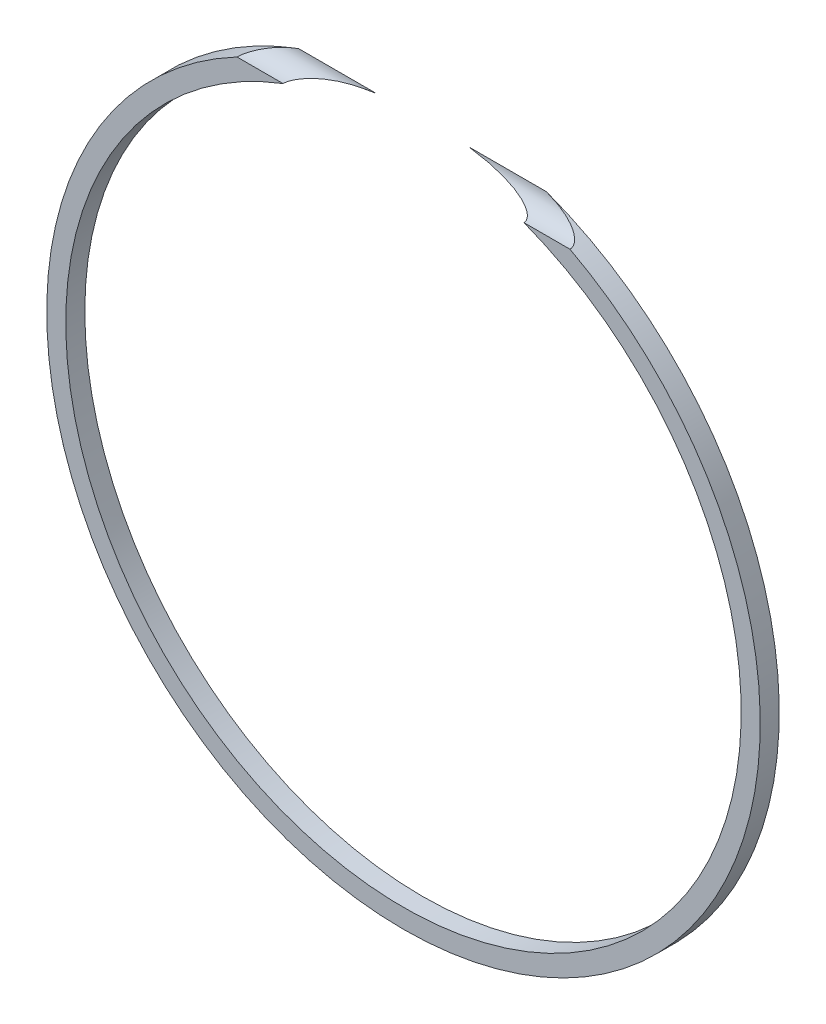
ISO-10303-21;
HEADER;
FILE_DESCRIPTION(('STEP AP214'),'2;1');
FILE_NAME('part.step','',(''),(''),'','','');
FILE_SCHEMA(('AUTOMOTIVE_DESIGN { 1 0 10303 214 1 1 1 1 }'));
ENDSEC;
DATA;
#1=APPLICATION_CONTEXT('core data for automotive mechanical design processes');
#2=APPLICATION_PROTOCOL_DEFINITION('international standard','automotive_design',2000,#1);
#3=PRODUCT_CONTEXT('',#1,'mechanical');
#4=PRODUCT('Part','Part','',(#3));
#5=PRODUCT_RELATED_PRODUCT_CATEGORY('part','',(#4));
#6=PRODUCT_DEFINITION_FORMATION('','',#4);
#7=PRODUCT_DEFINITION_CONTEXT('part definition',#1,'design');
#8=PRODUCT_DEFINITION('design','',#6,#7);
#9=PRODUCT_DEFINITION_SHAPE('','',#8);
#10=(LENGTH_UNIT() NAMED_UNIT(*) SI_UNIT(.MILLI.,.METRE.));
#11=(NAMED_UNIT(*) PLANE_ANGLE_UNIT() SI_UNIT($,.RADIAN.));
#12=(NAMED_UNIT(*) SI_UNIT($,.STERADIAN.) SOLID_ANGLE_UNIT());
#13=UNCERTAINTY_MEASURE_WITH_UNIT(LENGTH_MEASURE(1.E-05),#10,'distance_accuracy_value','');
#14=(GEOMETRIC_REPRESENTATION_CONTEXT(3) GLOBAL_UNCERTAINTY_ASSIGNED_CONTEXT((#13)) GLOBAL_UNIT_ASSIGNED_CONTEXT((#10,
#11,#12)) REPRESENTATION_CONTEXT('',''));
#15=CARTESIAN_POINT('',(0.,0.,0.));
#16=DIRECTION('',(0.,0.,1.));
#17=DIRECTION('',(1.,0.,0.));
#18=AXIS2_PLACEMENT_3D('',#15,#16,#17);
#19=CARTESIAN_POINT('',(0.,0.,1.2));
#20=DIRECTION('',(0.,0.,1.));
#21=DIRECTION('',(1.,0.,0.));
#22=AXIS2_PLACEMENT_3D('',#19,#20,#21);
#23=PLANE('',#22);
#24=DIRECTION('',(1.,0.,0.));
#25=VECTOR('',#24,1.);
#26=CARTESIAN_POINT('',(-22.5,19.8997487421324,1.2));
#27=LINE('',#26,#25);
#28=CARTESIAN_POINT('',(-10.5,19.8997487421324,1.2));
#29=VERTEX_POINT('',#28);
#30=CARTESIAN_POINT('',(-7.59539334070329,19.8997487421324,1.2));
#31=VERTEX_POINT('',#30);
#32=EDGE_CURVE('E61',#29,#31,#27,.T.);
#33=ORIENTED_EDGE('',*,*,#32,.F.);
#34=CARTESIAN_POINT('',(0.,0.,1.2));
#35=DIRECTION('',(0.,0.,1.));
#36=DIRECTION('',(1.,0.,0.));
#37=AXIS2_PLACEMENT_3D('',#34,#35,#36);
#38=CIRCLE('',#37,22.5);
#39=CARTESIAN_POINT('',(10.5,19.8997487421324,1.2));
#40=VERTEX_POINT('',#39);
#41=EDGE_CURVE('E93',#29,#40,#38,.T.);
#42=ORIENTED_EDGE('',*,*,#41,.T.);
#43=CARTESIAN_POINT('',(7.59539334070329,19.8997487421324,1.2));
#44=VERTEX_POINT('',#43);
#45=EDGE_CURVE('E85',#44,#40,#27,.T.);
#46=ORIENTED_EDGE('',*,*,#45,.F.);
#47=CARTESIAN_POINT('',(0.,0.,1.2));
#48=DIRECTION('',(0.,0.,1.));
#49=DIRECTION('',(1.,0.,0.));
#50=AXIS2_PLACEMENT_3D('',#47,#48,#49);
#51=CIRCLE('',#50,21.3);
#52=EDGE_CURVE('E97',#31,#44,#51,.T.);
#53=ORIENTED_EDGE('',*,*,#52,.F.);
#54=EDGE_LOOP('',(#33,#42,#46,#53));
#55=FACE_BOUND('',#54,.T.);
#56=ADVANCED_FACE('F33',(#55),#23,.T.);
#57=CARTESIAN_POINT('',(0.,0.,0.));
#58=DIRECTION('',(0.,0.,1.));
#59=DIRECTION('',(1.,0.,0.));
#60=AXIS2_PLACEMENT_3D('',#57,#58,#59);
#61=PLANE('',#60);
#62=CARTESIAN_POINT('',(0.,0.,0.));
#63=DIRECTION('',(0.,0.,1.));
#64=DIRECTION('',(1.,0.,0.));
#65=AXIS2_PLACEMENT_3D('',#62,#63,#64);
#66=CIRCLE('',#65,22.5);
#67=CARTESIAN_POINT('',(-7.81348853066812,21.0997487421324,0.));
#68=VERTEX_POINT('',#67);
#69=CARTESIAN_POINT('',(7.81348853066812,21.0997487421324,0.));
#70=VERTEX_POINT('',#69);
#71=EDGE_CURVE('E91',#68,#70,#66,.T.);
#72=ORIENTED_EDGE('',*,*,#71,.F.);
#73=DIRECTION('',(1.,0.,0.));
#74=VECTOR('',#73,1.);
#75=CARTESIAN_POINT('',(-22.5,21.0997487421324,0.));
#76=LINE('',#75,#74);
#77=CARTESIAN_POINT('',(-2.91386393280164,21.0997487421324,0.));
#78=VERTEX_POINT('',#77);
#79=EDGE_CURVE('E77',#68,#78,#76,.T.);
#80=ORIENTED_EDGE('',*,*,#79,.T.);
#81=CARTESIAN_POINT('',(0.,0.,0.));
#82=DIRECTION('',(0.,0.,1.));
#83=DIRECTION('',(1.,0.,0.));
#84=AXIS2_PLACEMENT_3D('',#81,#82,#83);
#85=CIRCLE('',#84,21.3);
#86=CARTESIAN_POINT('',(2.91386393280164,21.0997487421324,0.));
#87=VERTEX_POINT('',#86);
#88=EDGE_CURVE('E94',#78,#87,#85,.T.);
#89=ORIENTED_EDGE('',*,*,#88,.T.);
#90=EDGE_CURVE('E54',#87,#70,#76,.T.);
#91=ORIENTED_EDGE('',*,*,#90,.T.);
#92=EDGE_LOOP('',(#72,#80,#89,#91));
#93=FACE_BOUND('',#92,.T.);
#94=ADVANCED_FACE('F96',(#93),#61,.F.);
#95=CARTESIAN_POINT('',(0.,0.,1.2));
#96=DIRECTION('',(0.,0.,-1.));
#97=DIRECTION('',(-1.,0.,0.));
#98=AXIS2_PLACEMENT_3D('',#95,#96,#97);
#99=CYLINDRICAL_SURFACE('',#98,22.5);
#100=ORIENTED_EDGE('',*,*,#41,.F.);
#101=CARTESIAN_POINT('',(-10.5,19.8997487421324,1.2));
#102=CARTESIAN_POINT('',(-10.5000735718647,19.8997075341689,1.16593207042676));
#103=CARTESIAN_POINT('',(-10.4972544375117,19.9011975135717,1.13197076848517));
#104=CARTESIAN_POINT('',(-10.4865066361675,19.9068641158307,1.06545761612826));
#105=CARTESIAN_POINT('',(-10.4786330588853,19.9110117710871,1.03289456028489));
#106=CARTESIAN_POINT('',(-10.4561510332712,19.9228283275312,0.962480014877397));
#107=CARTESIAN_POINT('',(-10.4404249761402,19.9310799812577,0.925089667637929));
#108=CARTESIAN_POINT('',(-10.4037683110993,19.9502390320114,0.853582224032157));
#109=CARTESIAN_POINT('',(-10.3828150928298,19.9611579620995,0.819480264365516));
#110=CARTESIAN_POINT('',(-10.3246976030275,19.9913025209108,0.73720601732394));
#111=CARTESIAN_POINT('',(-10.2848940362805,20.0118272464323,0.691396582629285));
#112=CARTESIAN_POINT('',(-10.1995869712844,20.0554416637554,0.606967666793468));
#113=CARTESIAN_POINT('',(-10.15407213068,20.0785364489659,0.568362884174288));
#114=CARTESIAN_POINT('',(-10.0620292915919,20.1248123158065,0.499196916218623));
#115=CARTESIAN_POINT('',(-10.0157070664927,20.147913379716,0.468302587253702));
#116=CARTESIAN_POINT('',(-9.920706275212,20.1948607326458,0.41098102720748));
#117=CARTESIAN_POINT('',(-9.87202560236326,20.2187076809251,0.38455788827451));
#118=CARTESIAN_POINT('',(-9.77288202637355,20.2668157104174,0.335474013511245));
#119=CARTESIAN_POINT('',(-9.72241587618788,20.2910774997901,0.312820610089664));
#120=CARTESIAN_POINT('',(-9.6201911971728,20.3397427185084,0.270795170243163));
#121=CARTESIAN_POINT('',(-9.56843217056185,20.3641461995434,0.251424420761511));
#122=CARTESIAN_POINT('',(-9.40166590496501,20.4419814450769,0.194132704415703));
#123=CARTESIAN_POINT('',(-9.28477189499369,20.4953590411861,0.161605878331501));
#124=CARTESIAN_POINT('',(-9.04803222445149,20.6009703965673,0.106957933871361));
#125=CARTESIAN_POINT('',(-8.92818324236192,20.6532027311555,0.0848491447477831));
#126=CARTESIAN_POINT('',(-8.68652874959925,20.7559981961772,0.049001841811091));
#127=CARTESIAN_POINT('',(-8.56472279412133,20.8065609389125,0.0352652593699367));
#128=CARTESIAN_POINT('',(-8.31974405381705,20.9057247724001,0.0147082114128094));
#129=CARTESIAN_POINT('',(-8.19657114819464,20.9543256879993,0.00788836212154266));
#130=CARTESIAN_POINT('',(-8.02974301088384,21.0184530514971,0.00264165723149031));
#131=CARTESIAN_POINT('',(-7.98651198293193,21.0349178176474,0.00164115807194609));
#132=CARTESIAN_POINT('',(-7.90003359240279,21.0675484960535,0.000321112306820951));
#133=CARTESIAN_POINT('',(-7.8567864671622,21.0837149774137,9.83288500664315E-08));
#134=CARTESIAN_POINT('',(-7.81348853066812,21.0997487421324,0.));
#135=B_SPLINE_CURVE_WITH_KNOTS('',3,(#101,#102,#103,#104,#105,#106,#107,#108,#109,#110,#111,
#112,#113,#114,#115,#116,#117,#118,#119,#120,#121,#122,#123,#124,#125,#126,#127,#128,#129,#130,
#131,#132,#133,#134),.UNSPECIFIED.,.F.,.F.,(4,2,2,2,2,2,2,2,2,2,2,2,2,2,2,2,4),(0.,
0.101882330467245,0.20267264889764,0.326168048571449,0.450207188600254,0.641318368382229,
0.832815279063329,1.01339236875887,1.19413384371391,1.37522286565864,1.55638271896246,
1.9533722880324,2.35083050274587,2.74838037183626,3.14596565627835,3.28477501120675,
3.42328429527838),.UNSPECIFIED.);
#136=EDGE_CURVE('E80',#29,#68,#135,.T.);
#137=ORIENTED_EDGE('',*,*,#136,.T.);
#138=ORIENTED_EDGE('',*,*,#71,.T.);
#139=CARTESIAN_POINT('',(7.81348853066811,21.0997487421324,0.));
#140=CARTESIAN_POINT('',(7.8746874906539,21.0770860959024,1.72250712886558E-06));
#141=CARTESIAN_POINT('',(7.93578641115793,21.0541575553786,0.000641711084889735));
#142=CARTESIAN_POINT('',(8.05776390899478,21.0077771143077,0.00330393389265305));
#143=CARTESIAN_POINT('',(8.11864245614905,20.9843251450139,0.00532635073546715));
#144=CARTESIAN_POINT('',(8.30119667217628,20.913087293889,0.0136394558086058));
#145=CARTESIAN_POINT('',(8.42248457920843,20.8645329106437,0.0221770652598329));
#146=CARTESIAN_POINT('',(8.66292915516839,20.7658482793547,0.0462769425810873));
#147=CARTESIAN_POINT('',(8.78209394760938,20.7157283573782,0.0617996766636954));
#148=CARTESIAN_POINT('',(9.01826189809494,20.6140107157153,0.101345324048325));
#149=CARTESIAN_POINT('',(9.13526745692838,20.5624148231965,0.125358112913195));
#150=CARTESIAN_POINT('',(9.33069743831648,20.474271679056,0.175067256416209));
#151=CARTESIAN_POINT('',(9.40993668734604,20.4379683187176,0.197982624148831));
#152=CARTESIAN_POINT('',(9.56676158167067,20.3650330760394,0.250146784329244));
#153=CARTESIAN_POINT('',(9.64433632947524,20.3284004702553,0.27942827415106));
#154=CARTESIAN_POINT('',(9.77106963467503,20.2676927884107,0.334691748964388));
#155=CARTESIAN_POINT('',(9.82109934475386,20.2434927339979,0.358532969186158));
#156=CARTESIAN_POINT('',(9.91933130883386,20.1955403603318,0.410281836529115));
#157=CARTESIAN_POINT('',(9.96753195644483,20.1717884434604,0.438192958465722));
#158=CARTESIAN_POINT('',(10.0609714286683,20.1253460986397,0.498586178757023));
#159=CARTESIAN_POINT('',(10.1062293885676,20.1026491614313,0.531033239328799));
#160=CARTESIAN_POINT('',(10.1929380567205,20.0588224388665,0.601508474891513));
#161=CARTESIAN_POINT('',(10.2343973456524,20.037689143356,0.639523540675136));
#162=CARTESIAN_POINT('',(10.2999507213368,20.004048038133,0.709635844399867));
#163=CARTESIAN_POINT('',(10.3255001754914,19.9908669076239,0.740036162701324));
#164=CARTESIAN_POINT('',(10.372890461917,19.9663179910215,0.804373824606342));
#165=CARTESIAN_POINT('',(10.3947283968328,19.9549516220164,0.838313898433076));
#166=CARTESIAN_POINT('',(10.4336043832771,19.934652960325,0.910230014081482));
#167=CARTESIAN_POINT('',(10.4505717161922,19.9257565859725,0.948255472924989));
#168=CARTESIAN_POINT('',(10.4775694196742,19.911574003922,1.02728285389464));
#169=CARTESIAN_POINT('',(10.4876283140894,19.90627295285,1.06827175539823));
#170=CARTESIAN_POINT('',(10.4957109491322,19.9020113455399,1.12482502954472));
#171=CARTESIAN_POINT('',(10.497314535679,19.9011655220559,1.13979303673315));
#172=CARTESIAN_POINT('',(10.499459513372,19.9000339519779,1.16983742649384));
#173=CARTESIAN_POINT('',(10.5000000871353,19.8997486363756,1.1849138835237));
#174=CARTESIAN_POINT('',(10.5000000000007,19.8997487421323,1.19999999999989));
#175=B_SPLINE_CURVE_WITH_KNOTS('',3,(#139,#140,#141,#142,#143,#144,#145,#146,#147,#148,#149,
#150,#151,#152,#153,#154,#155,#156,#157,#158,#159,#160,#161,#162,#163,#164,#165,#166,#167,#168,
#169,#170,#171,#172,#173,#174),.UNSPECIFIED.,.F.,.F.,(4,2,2,2,2,2,2,2,2,2,2,2,2,2,2,2,2,4),(0.,
0.195773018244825,0.39157190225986,0.784148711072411,1.17453106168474,1.5644494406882,
1.83464030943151,2.10625316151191,2.28754469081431,2.46899192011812,2.64910794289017,
2.82880652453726,2.95405752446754,3.07940585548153,3.20649144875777,3.33304911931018,
3.37824172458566,3.42346906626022),.UNSPECIFIED.);
#176=EDGE_CURVE('E116',#70,#40,#175,.T.);
#177=ORIENTED_EDGE('',*,*,#176,.T.);
#178=EDGE_LOOP('',(#100,#137,#138,#177));
#179=FACE_BOUND('',#178,.T.);
#180=ADVANCED_FACE('F35',(#179),#99,.T.);
#181=CARTESIAN_POINT('',(0.,0.,1.2));
#182=DIRECTION('',(0.,0.,-1.));
#183=DIRECTION('',(-1.,0.,0.));
#184=AXIS2_PLACEMENT_3D('',#181,#182,#183);
#185=CYLINDRICAL_SURFACE('',#184,21.3);
#186=CARTESIAN_POINT('',(-7.59539334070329,19.8997487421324,1.2));
#187=CARTESIAN_POINT('',(-7.59546532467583,19.8997197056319,1.17292005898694));
#188=CARTESIAN_POINT('',(-7.5929954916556,19.9006640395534,1.14594489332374));
#189=CARTESIAN_POINT('',(-7.58364914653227,19.904228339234,1.09322292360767));
#190=CARTESIAN_POINT('',(-7.576829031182,19.9068268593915,1.06746486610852));
#191=CARTESIAN_POINT('',(-7.5573735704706,19.914221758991,1.01156777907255));
#192=CARTESIAN_POINT('',(-7.54374498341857,19.9193923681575,0.981831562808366));
#193=CARTESIAN_POINT('',(-7.51216299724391,19.9313245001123,0.92498526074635));
#194=CARTESIAN_POINT('',(-7.49418703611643,19.9380943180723,0.897889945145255));
#195=CARTESIAN_POINT('',(-7.44271863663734,19.9573817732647,0.829961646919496));
#196=CARTESIAN_POINT('',(-7.40663763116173,19.9708132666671,0.791375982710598));
#197=CARTESIAN_POINT('',(-7.32965334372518,19.9991970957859,0.720149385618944));
#198=CARTESIAN_POINT('',(-7.28874059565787,20.0141524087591,0.687520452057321));
#199=CARTESIAN_POINT('',(-7.20161189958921,20.0456739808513,0.625368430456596));
#200=CARTESIAN_POINT('',(-7.15522935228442,20.0622836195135,0.596104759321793));
#201=CARTESIAN_POINT('',(-7.06021650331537,20.0959172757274,0.541711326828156));
#202=CARTESIAN_POINT('',(-7.01158373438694,20.1129417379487,0.516586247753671));
#203=CARTESIAN_POINT('',(-6.91265765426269,20.1471563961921,0.46964921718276));
#204=CARTESIAN_POINT('',(-6.86236054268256,20.164346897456,0.447845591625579));
#205=CARTESIAN_POINT('',(-6.7606652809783,20.1986704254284,0.407052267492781));
#206=CARTESIAN_POINT('',(-6.70926770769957,20.215803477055,0.388061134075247));
#207=CARTESIAN_POINT('',(-6.57012444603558,20.2615868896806,0.340221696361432));
#208=CARTESIAN_POINT('',(-6.48159016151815,20.2900898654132,0.313528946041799));
#209=CARTESIAN_POINT('',(-6.3028719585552,20.3463165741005,0.265277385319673));
#210=CARTESIAN_POINT('',(-6.21268714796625,20.3740398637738,0.243721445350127));
#211=CARTESIAN_POINT('',(-6.03098392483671,20.4285644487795,0.204692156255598));
#212=CARTESIAN_POINT('',(-5.93946336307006,20.4553639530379,0.187226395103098));
#213=CARTESIAN_POINT('',(-5.75552748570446,20.5078779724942,0.155670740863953));
#214=CARTESIAN_POINT('',(-5.66311202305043,20.5335923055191,0.141581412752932));
#215=CARTESIAN_POINT('',(-5.38393673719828,20.6092333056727,0.103361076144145));
#216=CARTESIAN_POINT('',(-5.19611893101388,20.6573962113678,0.0834518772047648));
#217=CARTESIAN_POINT('',(-4.81885268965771,20.7486461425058,0.0515030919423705));
#218=CARTESIAN_POINT('',(-4.62940611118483,20.7917382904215,0.0394555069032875));
#219=CARTESIAN_POINT('',(-4.31240889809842,20.8592895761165,0.0240135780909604));
#220=CARTESIAN_POINT('',(-4.18523190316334,20.8851785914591,0.0190738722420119));
#221=CARTESIAN_POINT('',(-3.93034280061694,20.9346426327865,0.0111485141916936));
#222=CARTESIAN_POINT('',(-3.8026305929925,20.958217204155,0.00816324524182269));
#223=CARTESIAN_POINT('',(-3.54826384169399,21.0027688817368,0.00371775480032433));
#224=CARTESIAN_POINT('',(-3.42161431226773,21.0237730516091,0.00224016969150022));
#225=CARTESIAN_POINT('',(-3.16798306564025,21.063484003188,0.000385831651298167));
#226=CARTESIAN_POINT('',(-3.04100145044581,21.0821914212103,8.77315639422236E-06));
#227=CARTESIAN_POINT('',(-2.91386393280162,21.0997487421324,0.));
#228=B_SPLINE_CURVE_WITH_KNOTS('',3,(#186,#187,#188,#189,#190,#191,#192,#193,#194,#195,#196,
#197,#198,#199,#200,#201,#202,#203,#204,#205,#206,#207,#208,#209,#210,#211,#212,#213,#214,#215,
#216,#217,#218,#219,#220,#221,#222,#223,#224,#225,#226,#227),.UNSPECIFIED.,.F.,.F.,(4,2,2,2,2,2,
2,2,2,2,2,2,2,2,2,2,2,2,2,2,4),(0.,0.0809422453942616,0.160855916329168,0.259650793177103,
0.358969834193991,0.521573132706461,0.684500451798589,0.856140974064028,1.02797437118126,
1.20023165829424,1.37240076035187,1.66246948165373,1.95269991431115,2.24346458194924,
2.53427786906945,3.11867647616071,3.70247956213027,4.09208127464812,4.48175936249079,
4.86689716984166,5.25192803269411),.UNSPECIFIED.);
#229=EDGE_CURVE('E11',#31,#78,#228,.T.);
#230=ORIENTED_EDGE('',*,*,#229,.F.);
#231=ORIENTED_EDGE('',*,*,#52,.T.);
#232=CARTESIAN_POINT('',(2.91386393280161,21.0997487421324,0.));
#233=CARTESIAN_POINT('',(3.01315293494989,21.0860369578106,2.06072768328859E-06));
#234=CARTESIAN_POINT('',(3.11234370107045,21.0716245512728,0.000234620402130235));
#235=CARTESIAN_POINT('',(3.31051301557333,21.0414008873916,0.00132368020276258));
#236=CARTESIAN_POINT('',(3.40949155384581,21.0255895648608,0.00218020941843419));
#237=CARTESIAN_POINT('',(3.70627197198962,20.9760293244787,0.0059327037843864));
#238=CARTESIAN_POINT('',(3.90371705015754,20.9401819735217,0.0100122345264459));
#239=CARTESIAN_POINT('',(4.29748134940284,20.8629320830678,0.0229473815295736));
#240=CARTESIAN_POINT('',(4.49379987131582,20.8215264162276,0.0318056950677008));
#241=CARTESIAN_POINT('',(4.88472567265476,20.7332959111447,0.0563997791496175));
#242=CARTESIAN_POINT('',(5.07933377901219,20.686473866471,0.0721320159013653));
#243=CARTESIAN_POINT('',(5.34050134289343,20.6197464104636,0.100024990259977));
#244=CARTESIAN_POINT('',(5.40811143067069,20.6021163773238,0.107865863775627));
#245=CARTESIAN_POINT('',(5.54299084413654,20.5662374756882,0.124937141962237));
#246=CARTESIAN_POINT('',(5.61026016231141,20.5479885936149,0.13416757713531));
#247=CARTESIAN_POINT('',(5.81160102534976,20.4923077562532,0.164235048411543));
#248=CARTESIAN_POINT('',(5.94509518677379,20.4539698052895,0.187437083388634));
#249=CARTESIAN_POINT('',(6.14661237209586,20.3939790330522,0.22916903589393));
#250=CARTESIAN_POINT('',(6.21549845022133,20.3730881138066,0.244650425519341));
#251=CARTESIAN_POINT('',(6.35244079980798,20.3308048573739,0.278339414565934));
#252=CARTESIAN_POINT('',(6.42049721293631,20.3094126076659,0.296546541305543));
#253=CARTESIAN_POINT('',(6.55543169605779,20.2662607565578,0.336197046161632));
#254=CARTESIAN_POINT('',(6.62231137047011,20.2445017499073,0.357635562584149));
#255=CARTESIAN_POINT('',(6.7545728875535,20.2007571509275,0.404485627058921));
#256=CARTESIAN_POINT('',(6.81995544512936,20.1787716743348,0.429895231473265));
#257=CARTESIAN_POINT('',(6.94491919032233,20.136092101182,0.484116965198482));
#258=CARTESIAN_POINT('',(7.00461847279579,20.1153959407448,0.512652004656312));
#259=CARTESIAN_POINT('',(7.12126108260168,20.0743978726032,0.575444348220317));
#260=CARTESIAN_POINT('',(7.17820138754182,20.0540964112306,0.609707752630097));
#261=CARTESIAN_POINT('',(7.27693480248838,20.0184522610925,0.67846675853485));
#262=CARTESIAN_POINT('',(7.31954360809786,20.0029031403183,0.71166768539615));
#263=CARTESIAN_POINT('',(7.39973160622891,19.9733765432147,0.78428441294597));
#264=CARTESIAN_POINT('',(7.43732824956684,19.9593936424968,0.823677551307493));
#265=CARTESIAN_POINT('',(7.48851133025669,19.940224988,0.890029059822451));
#266=CARTESIAN_POINT('',(7.50515463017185,19.9339637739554,0.914299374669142));
#267=CARTESIAN_POINT('',(7.53507960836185,19.9226712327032,0.965128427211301));
#268=CARTESIAN_POINT('',(7.54836380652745,19.9176389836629,0.991685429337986));
#269=CARTESIAN_POINT('',(7.56896001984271,19.9098204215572,1.04300583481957));
#270=CARTESIAN_POINT('',(7.57684671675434,19.9068187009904,1.067502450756));
#271=CARTESIAN_POINT('',(7.58864430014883,19.9023244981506,1.11754075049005));
#272=CARTESIAN_POINT('',(7.59256584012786,19.9008279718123,1.14307944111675));
#273=CARTESIAN_POINT('',(7.59504119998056,19.8998830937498,1.17916015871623));
#274=CARTESIAN_POINT('',(7.59540058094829,19.8997458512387,1.1895818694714));
#275=CARTESIAN_POINT('',(7.59539334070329,19.8997487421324,1.2));
#276=B_SPLINE_CURVE_WITH_KNOTS('',3,(#232,#233,#234,#235,#236,#237,#238,#239,#240,#241,#242,
#243,#244,#245,#246,#247,#248,#249,#250,#251,#252,#253,#254,#255,#256,#257,#258,#259,#260,#261,
#262,#263,#264,#265,#266,#267,#268,#269,#270,#271,#272,#273,#274,#275),.UNSPECIFIED.,.F.,.F.,(4,
2,2,2,2,2,2,2,2,2,2,2,2,2,2,2,2,2,2,2,2,4),(0.,0.300687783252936,0.601389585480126,
1.20340348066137,1.80575752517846,2.40780227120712,2.61871527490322,2.82963290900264,
3.25181105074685,3.4726587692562,3.69346823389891,3.91394874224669,4.13432167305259,
4.34211270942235,4.55012645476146,4.71840392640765,4.88607928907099,4.9761161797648,
5.06608532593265,5.14350075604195,5.22070763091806,5.25196640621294),.UNSPECIFIED.);
#277=EDGE_CURVE('E47',#87,#44,#276,.T.);
#278=ORIENTED_EDGE('',*,*,#277,.F.);
#279=ORIENTED_EDGE('',*,*,#88,.F.);
#280=EDGE_LOOP('',(#230,#231,#278,#279));
#281=FACE_BOUND('',#280,.T.);
#282=ADVANCED_FACE('F106',(#281),#185,.F.);
#283=CARTESIAN_POINT('',(-22.5,21.0997487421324,1.2));
#284=DIRECTION('',(1.,0.,0.));
#285=DIRECTION('',(0.,0.,-1.));
#286=AXIS2_PLACEMENT_3D('',#283,#284,#285);
#287=CYLINDRICAL_SURFACE('',#286,1.2);
#288=ORIENTED_EDGE('',*,*,#90,.F.);
#289=ORIENTED_EDGE('',*,*,#277,.T.);
#290=ORIENTED_EDGE('',*,*,#45,.T.);
#291=ORIENTED_EDGE('',*,*,#176,.F.);
#292=EDGE_LOOP('',(#288,#289,#290,#291));
#293=FACE_BOUND('',#292,.T.);
#294=ADVANCED_FACE('F111',(#293),#287,.F.);
#295=ORIENTED_EDGE('',*,*,#32,.T.);
#296=ORIENTED_EDGE('',*,*,#229,.T.);
#297=ORIENTED_EDGE('',*,*,#79,.F.);
#298=ORIENTED_EDGE('',*,*,#136,.F.);
#299=EDGE_LOOP('',(#295,#296,#297,#298));
#300=FACE_BOUND('',#299,.T.);
#301=ADVANCED_FACE('F79',(#300),#287,.F.);
#302=CLOSED_SHELL('',(#56,#94,#180,#282,#294,#301));
#303=MANIFOLD_SOLID_BREP('B2',#302);
#304=ADVANCED_BREP_SHAPE_REPRESENTATION('',(#18,#303),#14);
#305=SHAPE_DEFINITION_REPRESENTATION(#9,#304);
ENDSEC;
END-ISO-10303-21;
